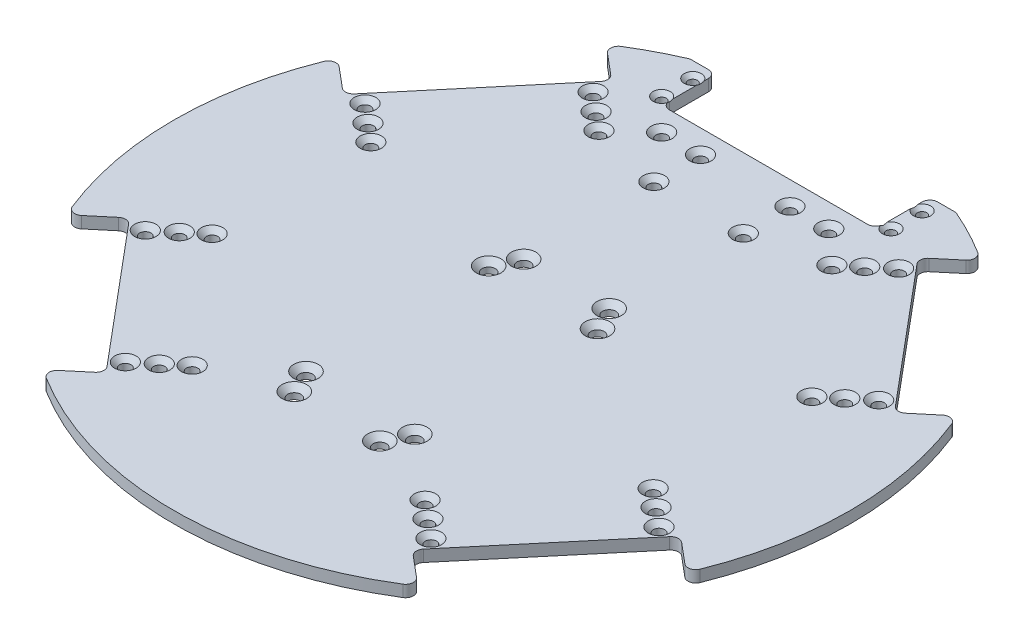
from build123d import *

# Parameters (mm, degrees)
ESBO_O1_R                                            = 87
RESSALTO_EXTRUS_O2_DEPTH                             = 3
CORTE_EXTRUS_O2_DEPTH                                = 3
FILETE1_R                                            = 2
ESCAREADO_PARA_PARAFUSO_COM_CABE_A_ESCAR_D           = 2.9
ESCAREADO_PARA_PARAFUSO_COM_CABE_A_ESCAR_CSINK_D     = 5.5
ESCAREADO_PARA_PARAFUSO_COM_CABE_A_ESCAR_CSINK_ANGLE = 90
ESBO_O5_W                                            = 68.38128399
ESBO_O5_H                                            = 7
CORTE_EXTRUS_O3_DEPTH                                = 3
FILETE2_R                                            = 2
ESCAREADO_PARA_PARAFUSO_COM_CABE_A_E_2_D             = 2.9
ESCAREADO_PARA_PARAFUSO_COM_CABE_A_E_2_DEPTH         = 7.25
ESCAREADO_PARA_PARAFUSO_COM_CABE_A_E_2_CSINK_D       = 5.5
ESCAREADO_PARA_PARAFUSO_COM_CABE_A_E_2_CSINK_ANGLE   = 90
ESCAREADO_PARA_PARAFUSO_COM_CABE_A_E_2_TIP           = 0.871247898
ESCAREADO_PARA_PARAFUSO_COM_CABE_A_E_3_D             = 3.4
ESCAREADO_PARA_PARAFUSO_COM_CABE_A_E_3_DEPTH         = 7.25
ESCAREADO_PARA_PARAFUSO_COM_CABE_A_E_3_CSINK_D       = 6.3
ESCAREADO_PARA_PARAFUSO_COM_CABE_A_E_3_CSINK_ANGLE   = 90
ESCAREADO_PARA_PARAFUSO_COM_CABE_A_E_3_TIP           = 1.021463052
ESCAREADO_PARA_PARAFUSO_COM_CABE_A_E_4_D             = 2.4
ESCAREADO_PARA_PARAFUSO_COM_CABE_A_E_4_DEPTH         = 10
ESCAREADO_PARA_PARAFUSO_COM_CABE_A_E_4_CSINK_D       = 4.4
ESCAREADO_PARA_PARAFUSO_COM_CABE_A_E_4_CSINK_ANGLE   = 90
ESCAREADO_PARA_PARAFUSO_COM_CABE_A_E_4_TIP           = 0.721032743


with BuildPart() as part:
    # Esbo_o1 → Ressalto-extrus_o2 (new body)
    with BuildSketch(Plane(origin=(0, 0, 0), x_dir=(1, 0, 0), z_dir=(0, 1, 0))):
        with Locations(Location((0, 0, 0), (0, 0, 270))):
            Circle(ESBO_O1_R)
    extrude(amount=RESSALTO_EXTRUS_O2_DEPTH)

    # Esbo_o2 → Corte-extrus_o2 (cut)
    with BuildSketch(Plane(origin=(0, 3, 0), x_dir=(1, 0, 0), z_dir=(0, 1, 0))):
        Polygon((39.390846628, 65.035323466), (70.887439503, 27.499145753), (82.394162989, 37.154433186), (66.645866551, 55.922522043), (50.897570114, 74.690610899), align=None)
        Polygon((50.897570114, -74.690610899), (82.394162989, -37.154433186), (70.887439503, -27.499145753), (39.390846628, -65.035323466), align=None)
        Polygon((-39.390846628, -65.035323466), (-70.887439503, -27.499145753), (-82.394162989, -37.154433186), (-50.897570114, -74.690610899), align=None)
        Polygon((-66.645866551, 55.922522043), (-82.394162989, 37.154433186), (-70.887439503, 27.499145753), (-39.390846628, 65.035323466), (-50.897570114, 74.690610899), align=None)
    extrude(amount=-CORTE_EXTRUS_O2_DEPTH, mode=Mode.SUBTRACT)

    # Filete1
    filete1_edges = [part.edges().sort_by_distance(p)[0] for p in [
        (-48.200357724, 1.5, -72.427380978),
        (-79.696950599, 1.5, -34.891203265),
        (-70.887439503, 1.5, -27.499145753),
        (-39.390846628, 1.5, -65.035323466),
        (-48.200357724, 1.5, 72.427380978),
        (-39.390846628, 1.5, 65.035323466),
        (-79.696950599, 1.5, 34.891203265),
        (-70.887439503, 1.5, 27.499145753),
        (79.696950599, 1.5, 34.891203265),
        (70.887439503, 1.5, 27.499145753),
        (48.200357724, 1.5, 72.427380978),
        (39.390846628, 1.5, 65.035323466),
        (79.696950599, 1.5, -34.891203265),
        (48.200357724, 1.5, -72.427380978),
        (39.390846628, 1.5, -65.035323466),
        (70.887439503, 1.5, -27.499145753),
    ]]
    fillet(filete1_edges, radius=FILETE1_R)

    # Escareado para parafuso com cabe_a escar (through all)
    with Locations(Plane(origin=(-66.073852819, 3, 28.257438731), x_dir=(0, 0, 1), z_dir=(0, 1, 0))):
        with Locations((0, 0), (-3.98528318, 4.749475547), (-7.842008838, 9.345742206), (31.905751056, 26.772103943), (27.920467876, 31.52157949), (24.063742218, 36.117846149), (-56.514877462, 0), (-52.529594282, 4.749475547), (-48.672868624, 9.345742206), (-88.420628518, 26.772103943), (-84.435345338, 31.52157949), (-80.57861968, 36.117846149), (-88.420628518, 105.375601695), (-84.435345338, 100.626126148), (-80.57861968, 96.029859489), (-56.514877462, 132.147705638), (-52.529594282, 127.398230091), (-48.672868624, 122.801963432), (0, 132.147705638), (-3.98528318, 127.398230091), (-7.842008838, 122.801963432), (24.063742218, 96.029859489), (27.920467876, 100.626126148), (31.905751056, 105.375601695)):
            CounterSinkHole(ESCAREADO_PARA_PARAFUSO_COM_CABE_A_ESCAR_D / 2, ESCAREADO_PARA_PARAFUSO_COM_CABE_A_ESCAR_CSINK_D / 2, counter_sink_angle=ESCAREADO_PARA_PARAFUSO_COM_CABE_A_ESCAR_CSINK_ANGLE)

    # Esbo_o5 → Corte-extrus_o3 (cut)
    with BuildSketch(Plane(origin=(0, 3, 0), x_dir=(1, 0, 0), z_dir=(0, 1, 0))):
        Polygon((27.5, 80), (-27.5, 80), (-27.5, 66), (0, 66), (27.5, 66), align=None)
        with Locations((0, 83.5)):
            Rectangle(ESBO_O5_W, ESBO_O5_H)
    extrude(amount=-CORTE_EXTRUS_O3_DEPTH, mode=Mode.SUBTRACT)

    # Filete2
    filete2_edges = [part.edges().sort_by_distance(p)[0] for p in [
        (-27.5, 1.5, -66),
        (-27.5, 1.5, -80),
        (-34.190641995, 1.5, -80),
        (34.190641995, 1.5, -80),
        (27.5, 1.5, -80),
        (27.5, 1.5, -66),
    ]]
    fillet(filete2_edges, radius=FILETE2_R)

    # Escareado para parafuso com cabe_a e 2
    with Locations(Plane(origin=(-21.5, 3, -60), x_dir=(0, 0, 1), z_dir=(0, 1, 0))):
        with Locations((0, 0), (0, 10), (12, 10), (12, 33), (0, 33), (0, 43)):
            CounterSinkHole(ESCAREADO_PARA_PARAFUSO_COM_CABE_A_E_2_D / 2, ESCAREADO_PARA_PARAFUSO_COM_CABE_A_E_2_CSINK_D / 2, depth=ESCAREADO_PARA_PARAFUSO_COM_CABE_A_E_2_DEPTH, counter_sink_angle=ESCAREADO_PARA_PARAFUSO_COM_CABE_A_E_2_CSINK_ANGLE)
            with Locations((0, 0, -(ESCAREADO_PARA_PARAFUSO_COM_CABE_A_E_2_DEPTH + ESCAREADO_PARA_PARAFUSO_COM_CABE_A_E_2_TIP / 2))):  # 118° drill point
                Cone(0, ESCAREADO_PARA_PARAFUSO_COM_CABE_A_E_2_D / 2, ESCAREADO_PARA_PARAFUSO_COM_CABE_A_E_2_TIP, mode=Mode.SUBTRACT)

    # Escareado para parafuso com cabe_a e 3
    with Locations(Plane(origin=(11, 3, -14), x_dir=(0, 0, 1), z_dir=(0, 1, 0))):
        with Locations((0, 0), (0, -22), (59, -22), (59, 0), (53, -25), (53, 3), (6, -25), (6, 3)):
            CounterSinkHole(ESCAREADO_PARA_PARAFUSO_COM_CABE_A_E_3_D / 2, ESCAREADO_PARA_PARAFUSO_COM_CABE_A_E_3_CSINK_D / 2, depth=ESCAREADO_PARA_PARAFUSO_COM_CABE_A_E_3_DEPTH, counter_sink_angle=ESCAREADO_PARA_PARAFUSO_COM_CABE_A_E_3_CSINK_ANGLE)
            with Locations((0, 0, -(ESCAREADO_PARA_PARAFUSO_COM_CABE_A_E_3_DEPTH + ESCAREADO_PARA_PARAFUSO_COM_CABE_A_E_3_TIP / 2))):  # 118° drill point
                Cone(0, ESCAREADO_PARA_PARAFUSO_COM_CABE_A_E_3_D / 2, ESCAREADO_PARA_PARAFUSO_COM_CABE_A_E_3_TIP, mode=Mode.SUBTRACT)

    # Escareado para parafuso com cabe_a e 4
    with Locations(Plane(origin=(-29.5, 3, -76), x_dir=(0, 0, 1), z_dir=(0, 1, 0))):
        with Locations((0, 0), (8, 0), (0, 59), (8, 59)):
            CounterSinkHole(ESCAREADO_PARA_PARAFUSO_COM_CABE_A_E_4_D / 2, ESCAREADO_PARA_PARAFUSO_COM_CABE_A_E_4_CSINK_D / 2, depth=ESCAREADO_PARA_PARAFUSO_COM_CABE_A_E_4_DEPTH, counter_sink_angle=ESCAREADO_PARA_PARAFUSO_COM_CABE_A_E_4_CSINK_ANGLE)
            with Locations((0, 0, -(ESCAREADO_PARA_PARAFUSO_COM_CABE_A_E_4_DEPTH + ESCAREADO_PARA_PARAFUSO_COM_CABE_A_E_4_TIP / 2))):  # 118° drill point
                Cone(0, ESCAREADO_PARA_PARAFUSO_COM_CABE_A_E_4_D / 2, ESCAREADO_PARA_PARAFUSO_COM_CABE_A_E_4_TIP, mode=Mode.SUBTRACT)


solid = part.part
